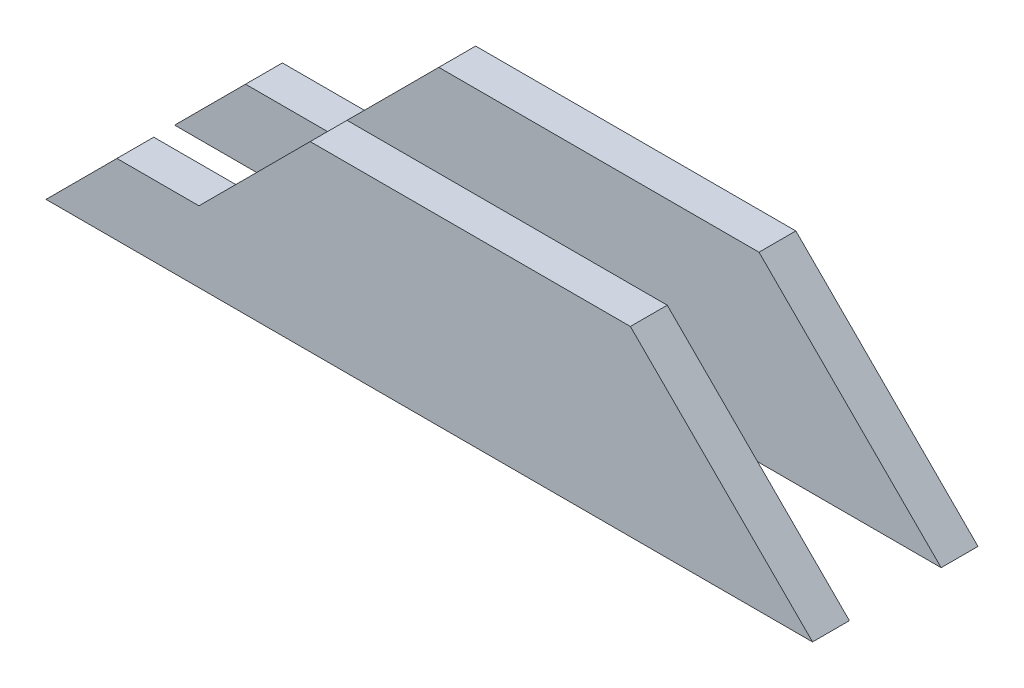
from build123d import *

# Parameters (mm, degrees)
SKETCH1_W                  = 140.0302
SKETCH1_H                  = 30.226
EXTRUDE1_DEPTH             = 12.954
EXTRUDE2_REACH             = 118.971
EXTRUDE2_DIRECTION_2_REACH = 118.971
EXTRUDE4_DEPTH             = 121.919924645
EXTRUDE4_DEPTH_BACK        = 121.919924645
SKETCH4_W                  = 16.764
SKETCH4_H                  = 41.721119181
EXTRUDE5_DEPTH             = 121.919924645
EXTRUDE5_DEPTH_BACK        = 121.919924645


with BuildPart() as part:
    # Sketch1 → Extrude1 (new body)
    with BuildSketch(Plane(origin=(0, 0, 0), x_dir=(1, 0, 0), z_dir=(0, 1, 0))):
        with Locations((-45.2501, 0)):
            Rectangle(SKETCH1_W, SKETCH1_H)
    extrude(amount=EXTRUDE1_DEPTH)

    # Extrude2: up to this face of the body (flat: up to its plane)
    extrude2_end = Plane(part.part.faces().sort_by_distance((-45.2501, 6.477, 15.113))[0])
    # Sketch2 → Extrude2 (add, up to the picked face)
    with BuildSketch(Plane.XY, mode=Mode.PRIVATE) as extrude2_sk1:
        Polygon((11.811, 12.954), (-8.509, 33.274), (-67.0052, 33.274), (-87.3252, 12.954), align=None)
    extrude2_tool1 = split(extrude(extrude2_sk1.sketch, amount=EXTRUDE2_REACH, mode=Mode.PRIVATE), bisect_by=extrude2_end, keep=Keep.BOTH, mode=Mode.PRIVATE)
    add(extrude2_tool1.solids().sort_by(Axis((-37.7571, 22.240866, 0), (0, 0, 1)))[0])

    # Extrude2 direction 2: up to this face of the body (flat: up to its plane)
    extrude2_direction_2_end = Plane(part.part.faces().sort_by_distance((-45.2501, 6.477, -15.113))[0])
    # Sketch2 → Extrude2 direction 2 (add, up to the picked face)
    with BuildSketch(Plane.XY, mode=Mode.PRIVATE) as extrude2_direction_2_sk1:
        Polygon((11.811, 12.954), (-8.509, 33.274), (-67.0052, 33.274), (-87.3252, 12.954), align=None)
    extrude2_direction_2_tool1 = split(extrude(extrude2_direction_2_sk1.sketch, amount=-EXTRUDE2_DIRECTION_2_REACH, mode=Mode.PRIVATE), bisect_by=extrude2_direction_2_end, keep=Keep.BOTH, mode=Mode.PRIVATE)
    add(extrude2_direction_2_tool1.solids().sort_by(Axis((-37.7571, 22.240866, 0), (0, 0, -1)))[0])

    # Sketch4 → Extrude4 (cut, two sides: drawn at the far end of the back side and taken through both)
    with BuildSketch(Plane(origin=(0, 0, 0), x_dir=(0, 0, -1), z_dir=(1, 0, 0)).offset(-EXTRUDE4_DEPTH_BACK)):
        with Locations((0, 12.41344041)):
            Rectangle(SKETCH4_W, SKETCH4_H)
    extrude(amount=EXTRUDE4_DEPTH + EXTRUDE4_DEPTH_BACK, mode=Mode.SUBTRACT)


with BuildPart() as extrude4_piece_1:
    # of the separate pieces the step leaves, piece 1, a body of its own (extrude4_pieces)
    add(part.part.solids().sort_by_distance((-115.2652, 0, 15.113))[0])


with BuildPart() as extrude4_piece_2:
    # of the separate pieces the step leaves, piece 2, a body of its own (extrude4_pieces)
    add(part.part.solids().sort_by_distance((-115.2652, 0, -15.113))[0])


with BuildPart() as extrude5_tool:
    # Sketch7 → Extrude5 (new, two sides: drawn at the far end of the back side and taken through both)
    with BuildSketch(Plane.XY.offset(-EXTRUDE5_DEPTH_BACK)):
        Polygon((11.811, 12.954), (24.765, 0), (24.765, 12.954), align=None)
        Polygon((-102.3112, 12.954), (-115.2652, 12.954), (-115.2652, 0), align=None)
    extrude(amount=EXTRUDE5_DEPTH + EXTRUDE5_DEPTH_BACK)


with BuildPart() as extrude4_piece_1_1:
    add(extrude4_piece_1.part)

    # Extrude5: cut by extrude5_tool
    add(extrude5_tool.part, mode=Mode.SUBTRACT)


with BuildPart() as extrude4_piece_2_1:
    add(extrude4_piece_2.part)

    # Extrude5: cut by extrude5_tool
    add(extrude5_tool.part, mode=Mode.SUBTRACT)


solid = Compound([extrude4_piece_1_1.part, extrude4_piece_2_1.part])
